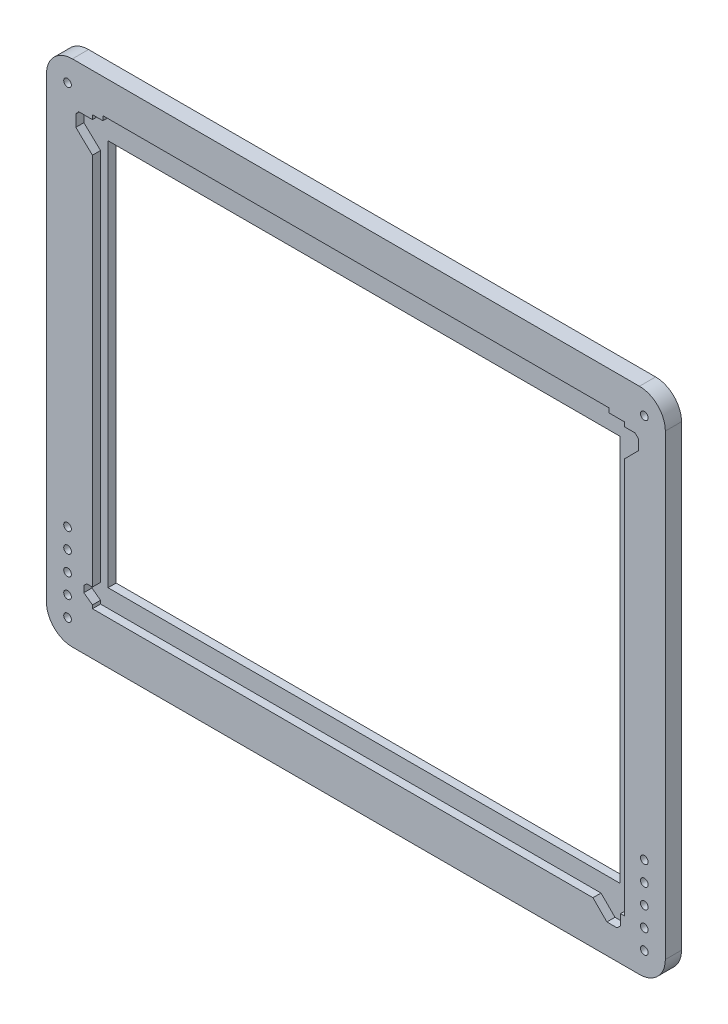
from build123d import *

# Parameters (mm, degrees)
MODEL_W             = 201.00036
MODEL_H             = 151.99868
BOSS_EXTRUDE1_DEPTH = 6.35
SKETCH2_W           = 201.00036
SKETCH2_H           = 151.99868
CUT_EXTRUDE6_DEPTH  = 553.53444062
CUT_EXTRUDE7_DEPTH  = 3.175
SKETCH5_R           = 1.5
CUT_EXTRUDE8_DEPTH  = 553.53444062
SKETCH6_W           = 198.705603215
SKETCH6_H           = 3.46165798
CUT_EXTRUDE9_DEPTH  = 3.175


with BuildPart() as part:
    # Model → Boss-Extrude1 (new body)
    # profile 1 of 3: a face of its own
    with BuildSketch(Plane.XY):
        with BuildLine():
            Line((285.97186037, 190.015000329), (508.635031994, 190.015000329))
            ThreePointArc((508.635031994, 190.015000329), (515.81923689, 187.039205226), (518.795031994, 179.855000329))
            Line((518.795031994, 179.855000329), (518.795031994, 0.147179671))
            ThreePointArc((518.795031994, 0.147179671), (515.81923689, -7.037025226), (508.635031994, -10.012820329))
            Line((508.635031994, -10.012820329), (285.97186037, -10.012820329))
            ThreePointArc((285.97186037, -10.012820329), (278.787655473, -7.037025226), (275.81186037, 0.147179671))
            Line((275.81186037, 0.147179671), (275.81186037, 179.855000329))
            ThreePointArc((275.81186037, 179.855000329), (278.787655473, 187.039205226), (285.97186037, 190.015000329))
        make_face()
        Polygon((502.804886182, 175.00092), (293.803526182, 175.00092), (293.803526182, 173.324512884), (288.399944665, 173.324512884), (287.268451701, 172.00118), (287.268451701, 168.00068), (287.268451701, 167.438933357), (293.803526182, 161.242662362), (293.803526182, 14.375857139), (291.537131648, 14.375857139), (290.417011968, 13.224623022), (290.417011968, 10.766582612), (293.803526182, 8.308542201), (293.803526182, 7.00024), (490.329938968, 7.00024), (495.804646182, 1.490470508), (499.805146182, 1.490470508), (501.169576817, 2.846218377), (501.169576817, 7.00024), (502.804886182, 7.00024), (502.804886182, 162.505326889), (508.244864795, 168.00068), (508.244864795, 172.00118), (506.802846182, 173.324512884), (502.804886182, 173.324512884), align=None, mode=Mode.SUBTRACT)
    # profile 2 of 3: a face of its own
    with BuildSketch(Plane.XY):
        Polygon((502.804886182, 173.324512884), (502.804886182, 175.00092), (293.803526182, 175.00092), (293.803526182, 173.324512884), (288.399944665, 173.324512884), (287.268451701, 172.00118), (287.268451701, 168.00068), (287.268451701, 167.438933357), (293.803526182, 161.242662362), (293.803526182, 14.375857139), (291.537131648, 14.375857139), (290.417011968, 13.224623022), (290.417011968, 10.766582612), (293.803526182, 8.308542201), (293.803526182, 7.00024), (490.329938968, 7.00024), (495.804646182, 1.490470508), (499.805146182, 1.490470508), (501.169576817, 2.846218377), (501.169576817, 7.00024), (502.804886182, 7.00024), (502.804886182, 162.505326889), (508.244864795, 168.00068), (508.244864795, 172.00118), (506.802846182, 173.324512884), align=None)
        with Locations((397.303446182, 89.99982)):
            Rectangle(MODEL_W, MODEL_H, mode=Mode.SUBTRACT)
    # profile 3 of 3: a face of its own
    with BuildSketch(Plane.XY):
        with Locations((397.303446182, 89.99982)):
            Rectangle(MODEL_W, MODEL_H)
    extrude(amount=BOSS_EXTRUDE1_DEPTH)

    # Sketch2 → Cut-Extrude6 (cut, through all)
    with BuildSketch(Plane.XY.offset(6.35)):
        with Locations((397.303446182, 90.00109)):
            Rectangle(SKETCH2_W, SKETCH2_H)
    extrude(amount=-CUT_EXTRUDE6_DEPTH, mode=Mode.SUBTRACT)

    # Sketch4 → Cut-Extrude7 (cut)
    with BuildSketch(Plane.XY.offset(6.35)):
        Polygon((502.852901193, 173.289969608), (506.850861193, 173.289969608), (508.292879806, 171.966636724), (508.292879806, 167.966136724), (502.852901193, 162.470783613), (502.852901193, 6.965696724), (501.217591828, 6.965696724), (501.217591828, 2.811675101), (499.853161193, 1.455927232), (495.852661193, 1.455927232), (490.377953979, 6.965696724), (293.851541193, 6.965696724), (293.851541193, 8.273998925), (290.465026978, 10.732039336), (290.465026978, 13.190079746), (291.585146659, 14.341313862), (293.851541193, 14.341313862), (293.851541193, 161.208119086), (287.316466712, 167.404390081), (287.316466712, 167.966136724), (287.316466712, 171.966636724), (288.447959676, 173.289969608), (293.851541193, 173.289969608), (293.851541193, 174.966376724), (502.852901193, 174.966376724), align=None)
    extrude(amount=-CUT_EXTRUDE7_DEPTH, mode=Mode.SUBTRACT)

    # Sketch5 → Cut-Extrude8 (cut, through all)
    with BuildSketch(Plane.XY.offset(6.35)):
        with Locations((284.070853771, 180.920119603)):
            Circle(SKETCH5_R)
        with Locations(Location((510.536038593, 180.920119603, 0), (0, 0, 180))):
            Circle(SKETCH5_R)
        with Locations((510.536038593, -0.917939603)):
            Circle(SKETCH5_R)
        with Locations(Location((284.070853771, -0.917939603, 0), (0, 0, 180))):
            Circle(SKETCH5_R)
        with Locations((284.070853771, 6.792501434)):
            Circle(SKETCH5_R)
        with Locations((284.070853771, 14.502942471)):
            Circle(SKETCH5_R)
        with Locations((284.070853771, 22.213383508)):
            Circle(SKETCH5_R)
        with Locations((284.070853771, 29.923824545)):
            Circle(SKETCH5_R)
        with Locations(Location((510.536038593, 29.923824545, 0), (0, 0, 180))):
            Circle(SKETCH5_R)
        with Locations(Location((510.536038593, 22.213383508, 0), (0, 0, 180))):
            Circle(SKETCH5_R)
        with Locations(Location((510.536038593, 14.502942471, 0), (0, 0, 180))):
            Circle(SKETCH5_R)
        with Locations(Location((510.536038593, 6.792501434, 0), (0, 0, 180))):
            Circle(SKETCH5_R)
    extrude(amount=-CUT_EXTRUDE8_DEPTH, mode=Mode.SUBTRACT)

    # Sketch6 → Cut-Extrude9 (cut)
    with BuildSketch(Plane.XY.offset(6.35)):
        with Locations((397.303446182, 174.966376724)):
            Rectangle(SKETCH6_W, SKETCH6_H)
    extrude(amount=-CUT_EXTRUDE9_DEPTH, mode=Mode.SUBTRACT)


solid = part.part
